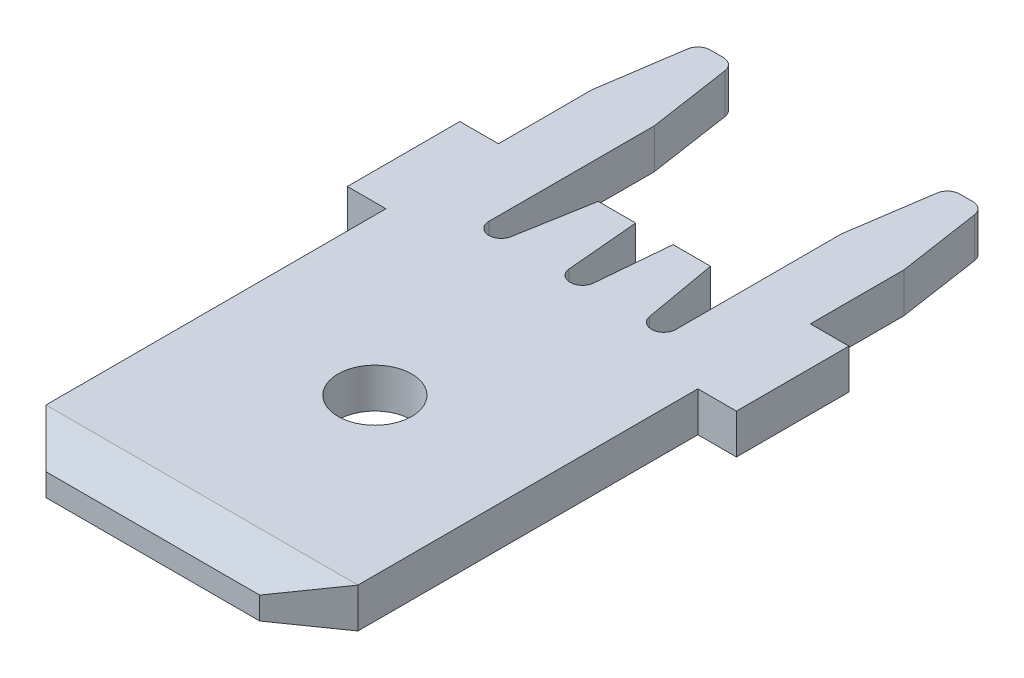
from build123d import *

# Parameters (mm, degrees)
SKETCH1_R      = 0.75
EXTRUDE1_DEPTH = 0.81
CHAMFER4_SIZE  = 1
CHAMFER4_SIZE2 = 0.176326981
CHAMFER5_SIZE  = 1
CHAMFER5_SIZE2 = 0.176326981
CHAMFER1_SIZE  = 1


with BuildPart() as part:
    # Sketch1 → Extrude1 (new body)
    with BuildSketch(Plane.XZ):
        with BuildLine():
            Line((-3.175, 4.52), (3.175, 4.52))
            Line((3.175, 4.52), (3.175, -3.4))
            Line((3.175, -3.4), (3.96, -3.4))
            Line((3.96, -3.4), (3.96, -5.69))
            Line((3.96, -5.69), (3.175, -5.69))
            Line((3.175, -5.69), (3.175, -7.595))
            Line((3.175, -7.595), (2.921867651, -9.286989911))
            ThreePointArc((2.921867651, -9.286989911), (2.837794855, -9.43940364), (2.674619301, -9.5))
            Line((2.674619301, -9.5), (2.405380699, -9.5))
            ThreePointArc((2.405380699, -9.5), (2.242205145, -9.43940364), (2.158132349, -9.286989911))
            Line((2.158132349, -9.286989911), (1.905, -7.595))
            Line((1.905, -7.595), (1.905, -4.225996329))
            ThreePointArc((1.905, -4.225996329), (1.676788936, -3.976947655), (1.408798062, -4.182584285))
            Line((1.408798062, -4.182584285), (1.143, -5.69))
            Line((1.143, -5.69), (0.381, -5.69))
            Line((0.381, -5.69), (0.249019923, -4.203881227))
            ThreePointArc((0.249019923, -4.203881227), (0, -3.975996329), (-0.249019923, -4.203881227))
            Line((-0.249019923, -4.203881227), (-0.381, -5.69))
            Line((-0.381, -5.69), (-1.143, -5.69))
            Line((-1.143, -5.69), (-1.408798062, -4.182584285))
            ThreePointArc((-1.408798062, -4.182584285), (-1.676788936, -3.976947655), (-1.905, -4.225996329))
            Line((-1.905, -4.225996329), (-1.905, -7.595))
            Line((-1.905, -7.595), (-2.158132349, -9.286989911))
            ThreePointArc((-2.158132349, -9.286989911), (-2.242205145, -9.43940364), (-2.405380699, -9.5))
            Line((-2.405380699, -9.5), (-2.674619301, -9.5))
            ThreePointArc((-2.674619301, -9.5), (-2.837794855, -9.43940364), (-2.921867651, -9.286989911))
            Line((-2.921867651, -9.286989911), (-3.175, -7.595))
            Line((-3.175, -7.595), (-3.175, -5.69))
            Line((-3.175, -5.69), (-3.96, -5.69))
            Line((-3.96, -5.69), (-3.96, -3.4))
            Line((-3.96, -3.4), (-3.175, -3.4))
            Line((-3.175, -3.4), (-3.175, 4.52))
        make_face()
        with Locations(Location((0, 0, 0), (0, 0, 270))):
            Circle(SKETCH1_R, mode=Mode.SUBTRACT)
    extrude(amount=EXTRUDE1_DEPTH)

    # Chamfer4
    chamfer4_edges = [part.edges().sort_by_distance(p)[0] for p in [
        (0, -0.81, 4.52),
    ]]
    chamfer4_side = [part.faces().sort_by_distance(p)[0] for p in [
        (0, -0.81, -1.422995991),
    ]]
    chamfer(chamfer4_edges, length=CHAMFER4_SIZE, length2=CHAMFER4_SIZE2, reference=chamfer4_side[0])

    # Chamfer5
    chamfer5_edges = [part.edges().sort_by_distance(p)[0] for p in [
        (0, 0, 4.52),
    ]]
    chamfer5_side = [part.faces().sort_by_distance(p)[0] for p in [
        (0, 0, -1.422995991),
    ]]
    chamfer(chamfer5_edges, length=CHAMFER5_SIZE, length2=CHAMFER5_SIZE2, reference=chamfer5_side[0])

    # Chamfer1
    chamfer1_edges = [part.edges().sort_by_distance(p)[0] for p in [
        (-3.175, -0.405, 4.52),
        (3.175, -0.405, 4.52),
    ]]
    chamfer(chamfer1_edges, length=CHAMFER1_SIZE)


solid = part.part
